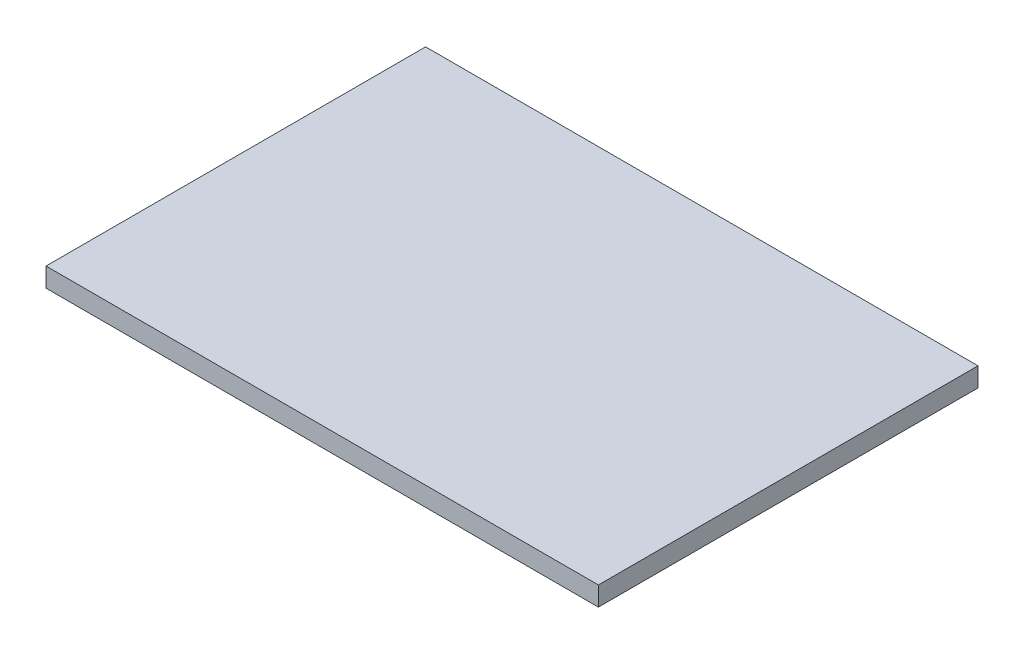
from build123d import *

# Parameters (mm, degrees)
SKETCH1_W           = 57.51
SKETCH1_H           = 39.52
BOSS_EXTRUDE1_DEPTH = 2


with BuildPart() as part:
    # Sketch1 → Boss-Extrude1 (new body)
    with BuildSketch(Plane(origin=(0, 0, 0), x_dir=(1, 0, 0), z_dir=(0, 1, 0))):
        with Locations((28.755, 19.76)):
            Rectangle(SKETCH1_W, SKETCH1_H)
    extrude(amount=BOSS_EXTRUDE1_DEPTH)


solid = part.part
